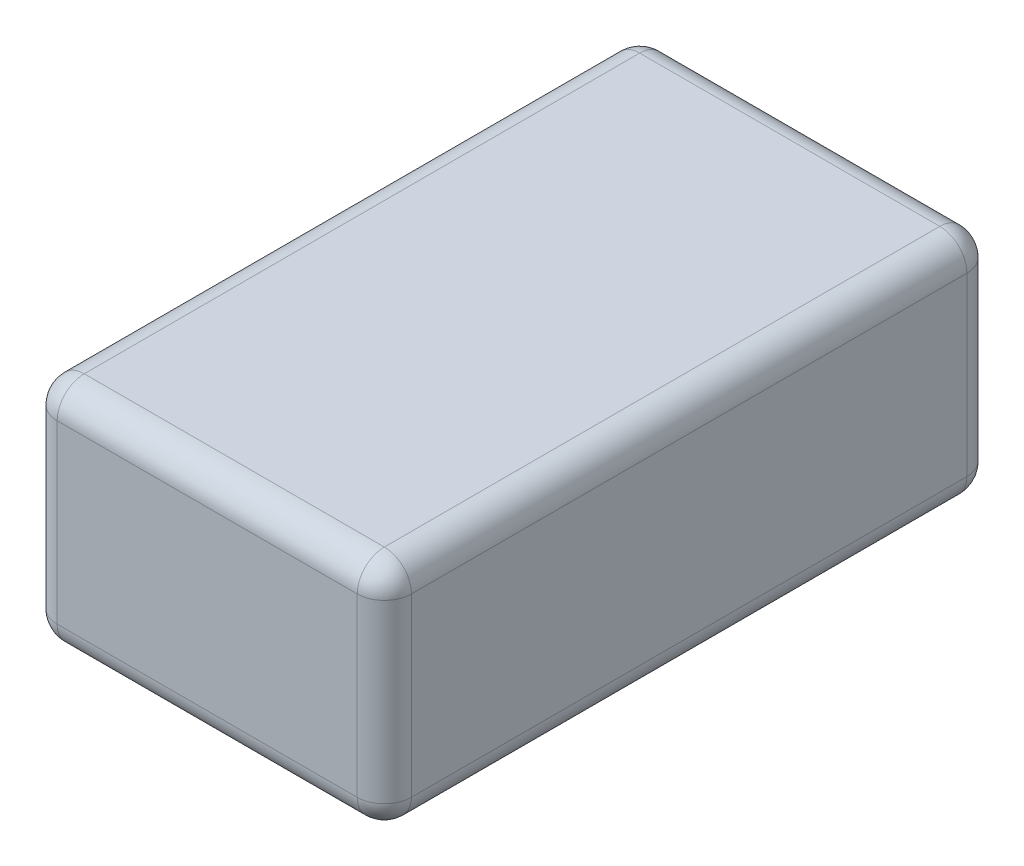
from build123d import *

# Parameters (mm, degrees)
SKETCH2_W           = 26.15
SKETCH2_H           = 45
BOSS_EXTRUDE1_DEPTH = 17
FILLET1_R           = 2
SKETCH3_R           = 4
SKETCH3_R_2         = 3
BOSS_EXTRUDE2_DEPTH = 2.8


with BuildPart() as part:
    # Sketch2 → Boss-Extrude1 (new body)
    with BuildSketch(Plane(origin=(0, 0, 0), x_dir=(1, 0, 0), z_dir=(0, 1, 0))):
        Rectangle(SKETCH2_W, SKETCH2_H)
    extrude(amount=BOSS_EXTRUDE1_DEPTH)

    # Fillet1
    fillet1_edges = [part.edges().sort_by_distance(p)[0] for p in [
        (-13.075, 17, 0),
        (0, 17, 22.5),
        (13.075, 17, 0),
        (0, 0, 22.5),
        (-13.075, 0, 0),
        (0, 0, -22.5),
        (13.075, 0, 0),
        (0, 17, -22.5),
        (13.075, 8.5, 22.5),
        (-13.075, 8.5, 22.5),
        (-13.075, 8.5, -22.5),
        (13.075, 8.5, -22.5),
    ]]
    fillet(fillet1_edges, radius=FILLET1_R)

    # Sketch3 → Boss-Extrude2 (add)
    with BuildSketch(Plane.XY.offset(-22.5)):
        with Locations((-6, 8.5)):
            Circle(SKETCH3_R)
        with Locations((6, 8.5)):
            Circle(SKETCH3_R_2)
    extrude(amount=-BOSS_EXTRUDE2_DEPTH)


solid = part.part
